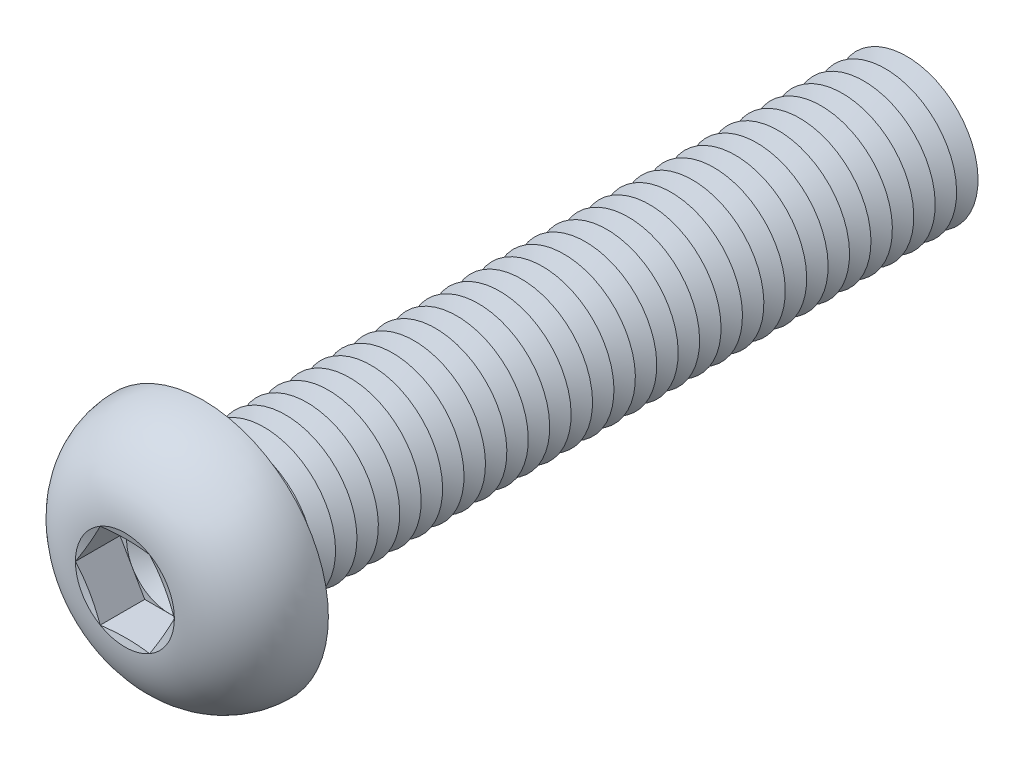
from build123d import *

# Parameters (mm, degrees)
FILLET1_R          = 0.75
LPATTERN1_COUNT    = 33
LPATTERN1_PITCH    = 1.5
CUT_EXTRUDE1_DEPTH = 3.12


with BuildPart() as part:
    # Sketch1 → Revolve1 (revolve)
    with BuildSketch(Plane(origin=(0, 0, 0), x_dir=(0, 0, -1), z_dir=(1, 0, 0))):
        with BuildLine():
            Line((0, 5), (0, 8.75))
            ThreePointArc((0, 8.75), (-3.814142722, 7.21429474), (-5.5, 3.4641))
            Line((-5.5, 3.4641), (-5.035898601, 1.73205))
            Line((-5.035898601, 1.73205), (-5.5, 1.73205))
            Line((-5.5, 1.73205), (-5.5, 0))
            Line((-5.5, 0), (50, 0))
            Line((50, 0), (50, 5))
            Line((50, 5), (0, 5))
        make_face()
    revolve(axis=Axis((0, 0, -50), (0, 0, 1)))

    # Fillet1
    fillet1_edges = [part.edges().sort_by_distance(p)[0] for p in [
        (0, -5, 0),
    ]]
    fillet(fillet1_edges, radius=FILLET1_R)

    # Sketch2 → Cut-Revolve1 (revolve, cut)
    with BuildSketch(Plane(origin=(0, 0, 0), x_dir=(0, 0, -1), z_dir=(1, 0, 0))):
        Polygon((49.25, 5), (50.75, 5), (50, 3.700961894), align=None)
    cut_revolve1 = revolve(axis=Axis((0, 0, -50), (0, 0, -1)), mode=Mode.SUBTRACT)

    # LPattern1: Cut-Revolve1 ×33
    with Locations(*[(0, 0, i * LPATTERN1_PITCH) for i in range(1, LPATTERN1_COUNT)]):
        add(cut_revolve1, mode=Mode.SUBTRACT)

    # Sketch3 → Cut-Extrude1 (cut)
    with BuildSketch(Plane.XY.offset(5.5)):
        Polygon((1.73205, 2.999998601), (-1.73205, 2.999998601), (-3.4641, 0), (-1.73205, -2.999998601), (1.73205, -2.999998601), (3.4641, 0), align=None)
    extrude(amount=-CUT_EXTRUDE1_DEPTH, mode=Mode.SUBTRACT)

    # Cut-Extrude2 cone 1 section (on through the dimple's axis) → Cut-Extrude2 (revolve, cut)
    with BuildSketch(Plane(origin=(0, 0, 2.38), x_dir=(0, -1, 0), z_dir=(1, 0, 0))):
        Polygon((0, 0), (2.999998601, 0), (0, 1.73205), align=None)
    revolve(axis=Axis((0, 0, 2.38), (0, 0, -1)), mode=Mode.SUBTRACT)


solid = part.part
